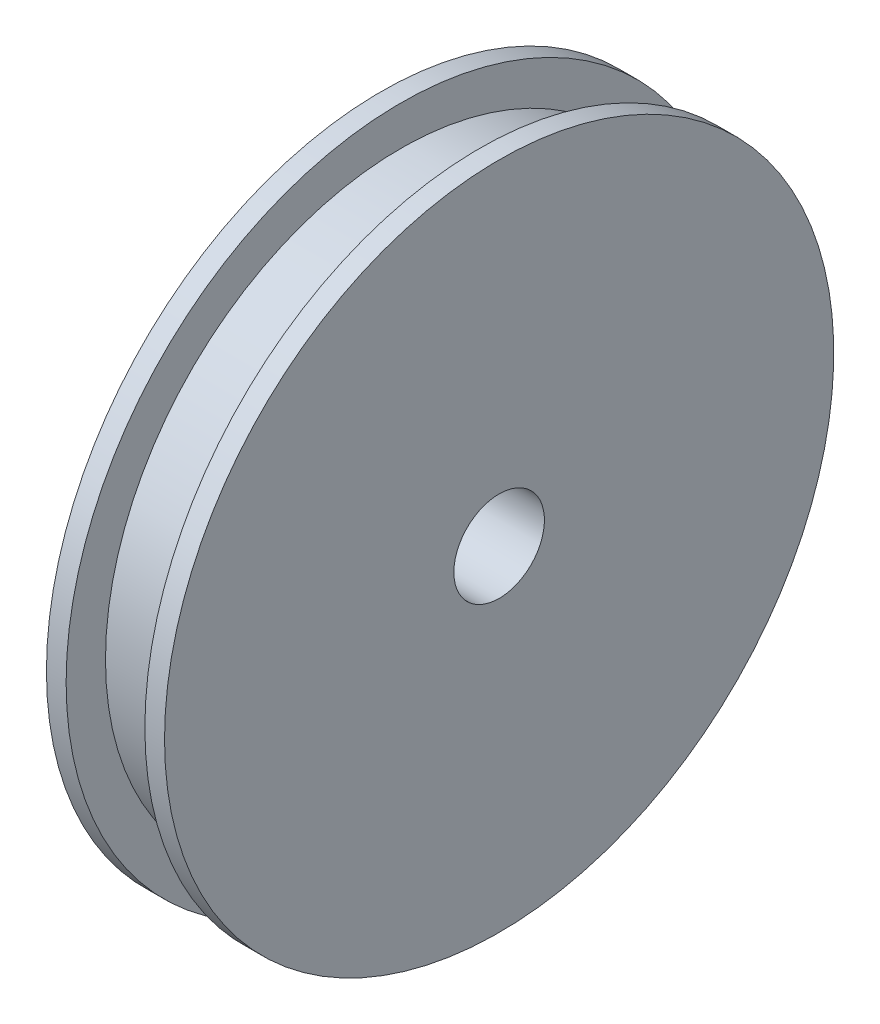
from build123d import *

# Parameters (mm, degrees)
SKETCH_1_R          = 15
EXTRUDE_1_DEPTH     = 3
SKETCH_2_R          = 17
EXTRUDE_2_DEPTH     = 1
SKETCH_3_R          = 4
EXTRUDE_3_DEPTH     = 3
SKETCH_4_R          = 2.3
CUT_EXTRUDE_1_DEPTH = 26.670995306
SKETCH_5_R          = 2.3
SKETCH_5_R_2        = 1.5
EXTRUDE_4_DEPTH     = 1
CHAMFER_1_SIZE      = 0.5


with BuildPart() as part:
    # Sketch 1 → Extrude 1 (new, symmetric)
    with BuildSketch(Plane(origin=(0, 0, 0), x_dir=(0, 0, -1), z_dir=(1, 0, 0))):
        Circle(SKETCH_1_R)
    extrude(amount=EXTRUDE_1_DEPTH, both=True)

    # Sketch 2 → Extrude 2 (add)
    with BuildSketch(Plane.ZY.offset(3)):
        Circle(SKETCH_2_R)
    extrude_2 = extrude(amount=-EXTRUDE_2_DEPTH)

    # Mirror 1: Extrude 2 across plane
    add(extrude_2.mirror(Plane(origin=(0, 0, 0), x_dir=(0, 0, 1), z_dir=(1, 0, 0))))

    # Sketch 3 → Extrude 3 (add)
    with BuildSketch(Plane.ZY.offset(3)):
        with Locations(Location((0, 0, 0), (0, 0, 180))):
            Circle(SKETCH_3_R)
    extrude(amount=EXTRUDE_3_DEPTH)

    # Sketch 4 → Cut-Extrude 1 (cut, through all)
    with BuildSketch(Plane.ZY.offset(6)):
        Circle(SKETCH_4_R)
    extrude(amount=-CUT_EXTRUDE_1_DEPTH, mode=Mode.SUBTRACT)

    # Sketch 5 → Extrude 4 (add)
    with BuildSketch(Plane.ZY.offset(3)):
        Circle(SKETCH_5_R)
        Circle(SKETCH_5_R_2, mode=Mode.SUBTRACT)
    extrude(amount=-EXTRUDE_4_DEPTH)

    # Chamfer 1
    chamfer_1_edges = [part.edges().sort_by_distance(p)[0] for p in [
        (-6, 0, -2.3),
    ]]
    chamfer(chamfer_1_edges, length=CHAMFER_1_SIZE)


solid = part.part
